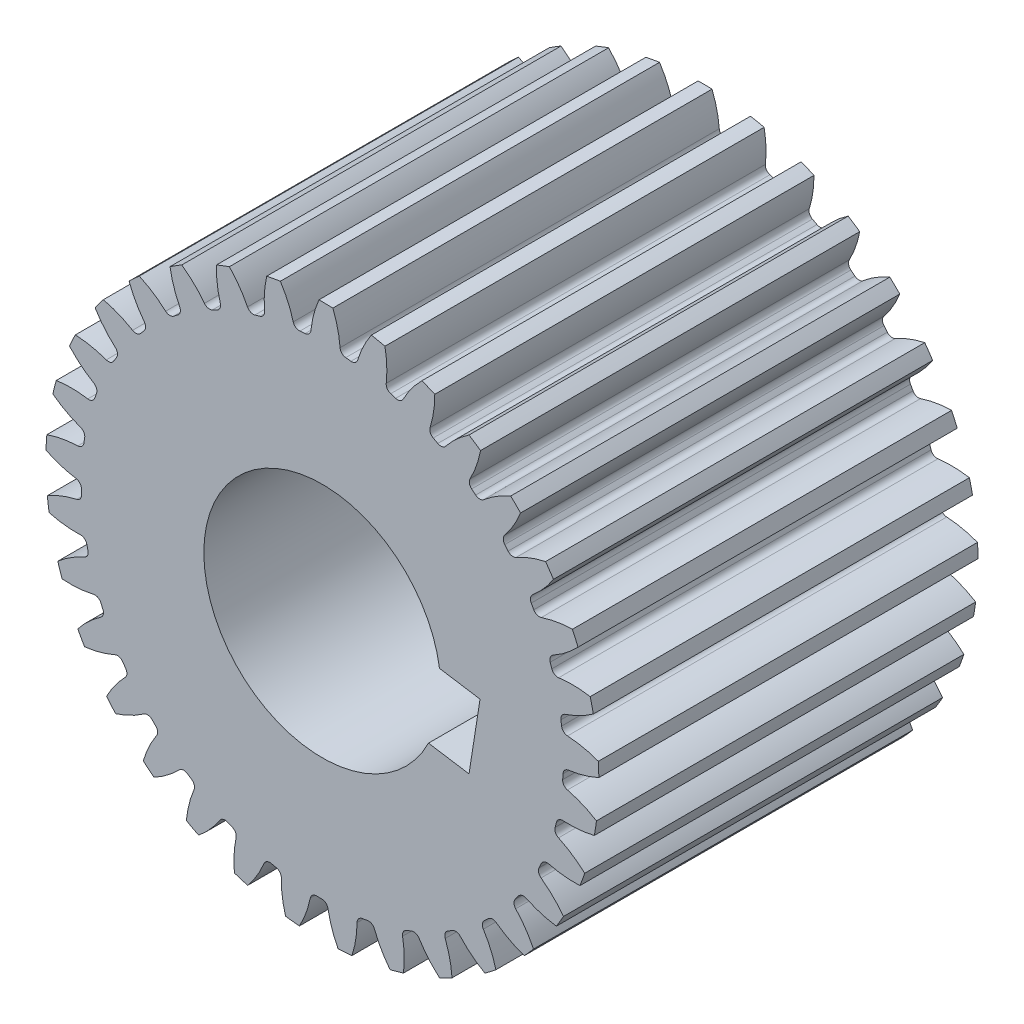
from build123d import *

# Parameters (mm, degrees)
SKETCH3_R         = 18.520833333
GEARBODY_DEPTH    = 25.4
TOOTHCUT_DEPTH    = 37.485648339
CIRPATTERN1_COUNT = 33
BOREDIA_R         = 7.9375
BORE_DEPTH        = 12700
KWY1_DEPTH        = 6350


with BuildPart() as part:
    # Sketch3 → gearBody (new body)
    with BuildSketch(Plane.XY):
        Circle(SKETCH3_R)
    extrude(amount=GEARBODY_DEPTH)

    # Sketch2 → toothCut (cut, through all)
    with BuildSketch(Plane.XY):
        with BuildLine():
            ThreePointArc((16.10072337, -1.149428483), (16.112174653, -0.975862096), (16.121754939, -0.802182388))
            ThreePointArc((16.121754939, -0.802182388), (16.233739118, -0.536184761), (16.490422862, -0.404242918))
            ThreePointArc((16.490422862, -0.404242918), (19.235901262, 0.559488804), (21.343620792, 2.565467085))
            ThreePointArc((21.343620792, 2.565467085), (21.457928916, -1.299637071), (20.877973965, -5.122691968))
            ThreePointArc((20.877973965, -5.122691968), (19.027764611, -2.876994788), (16.418668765, -1.588953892))
            ThreePointArc((16.418668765, -1.588953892), (16.179785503, -1.426997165), (16.10072337, -1.149428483))
        make_face()
    toothcut = extrude(amount=TOOTHCUT_DEPTH, mode=Mode.SUBTRACT)

    # CirPattern1: toothCut ×33 about axis
    cirpattern1_axis = Axis((0, 0, 0), (0, 0, 1))
    for i in range(1, CIRPATTERN1_COUNT):
        add(toothcut.rotate(cirpattern1_axis, i * 360 / CIRPATTERN1_COUNT), mode=Mode.SUBTRACT)

    # boreDia → bore (cut, symmetric)
    with BuildSketch(Plane.XY):
        Circle(BOREDIA_R)
    extrude(amount=BORE_DEPTH, both=True, mode=Mode.SUBTRACT)

    # kwy1sketch → kwy1 (cut, symmetric)
    with BuildSketch(Plane.XY):
        Polygon((10.564439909, 0.752179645), (9.825945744, -3.952714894), (3.944827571, -3.029597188), (0, 0), (4.683321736, 1.67529735), align=None)
    extrude(amount=KWY1_DEPTH, both=True, mode=Mode.SUBTRACT)


solid = part.part
